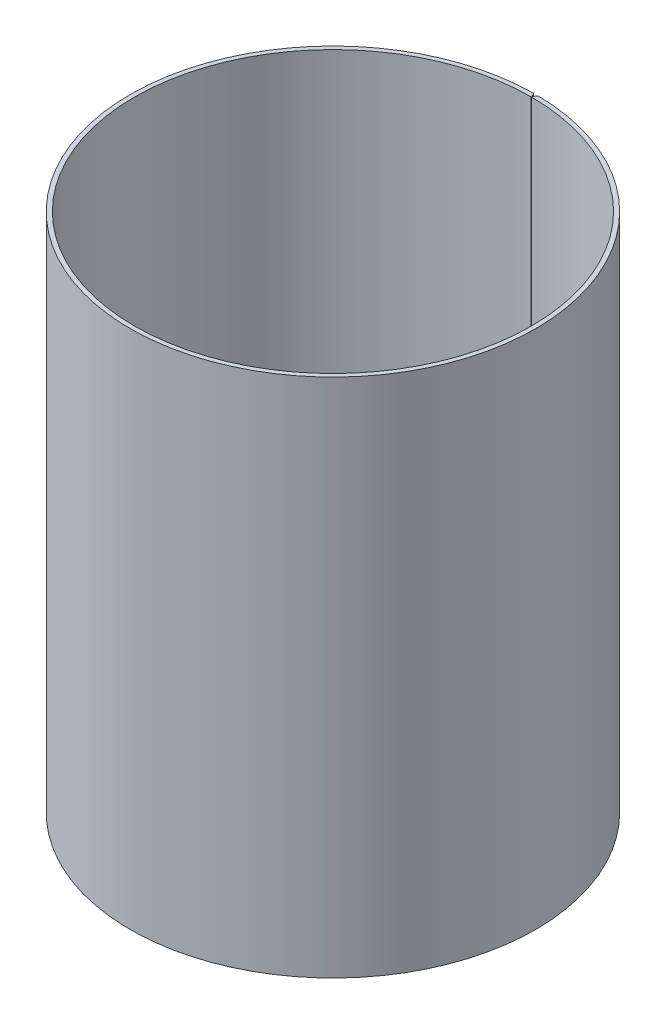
ISO-10303-21;
HEADER;
FILE_DESCRIPTION(('STEP AP214'),'2;1');
FILE_NAME('part.step','',(''),(''),'','','');
FILE_SCHEMA(('AUTOMOTIVE_DESIGN { 1 0 10303 214 1 1 1 1 }'));
ENDSEC;
DATA;
#1=APPLICATION_CONTEXT('core data for automotive mechanical design processes');
#2=APPLICATION_PROTOCOL_DEFINITION('international standard','automotive_design',2000,#1);
#3=PRODUCT_CONTEXT('',#1,'mechanical');
#4=PRODUCT('Part','Part','',(#3));
#5=PRODUCT_RELATED_PRODUCT_CATEGORY('part','',(#4));
#6=PRODUCT_DEFINITION_FORMATION('','',#4);
#7=PRODUCT_DEFINITION_CONTEXT('part definition',#1,'design');
#8=PRODUCT_DEFINITION('design','',#6,#7);
#9=PRODUCT_DEFINITION_SHAPE('','',#8);
#10=(LENGTH_UNIT() NAMED_UNIT(*) SI_UNIT(.MILLI.,.METRE.));
#11=(NAMED_UNIT(*) PLANE_ANGLE_UNIT() SI_UNIT($,.RADIAN.));
#12=(NAMED_UNIT(*) SI_UNIT($,.STERADIAN.) SOLID_ANGLE_UNIT());
#13=UNCERTAINTY_MEASURE_WITH_UNIT(LENGTH_MEASURE(1.E-05),#10,'distance_accuracy_value','');
#14=(GEOMETRIC_REPRESENTATION_CONTEXT(3) GLOBAL_UNCERTAINTY_ASSIGNED_CONTEXT((#13)) GLOBAL_UNIT_ASSIGNED_CONTEXT((#10,
#11,#12)) REPRESENTATION_CONTEXT('',''));
#15=CARTESIAN_POINT('',(0.,0.,0.));
#16=DIRECTION('',(0.,0.,1.));
#17=DIRECTION('',(1.,0.,0.));
#18=AXIS2_PLACEMENT_3D('',#15,#16,#17);
#19=CARTESIAN_POINT('',(0.,-762.,0.));
#20=DIRECTION('',(0.,1.,0.));
#21=DIRECTION('',(0.,0.,1.));
#22=AXIS2_PLACEMENT_3D('',#19,#20,#21);
#23=CYLINDRICAL_SURFACE('',#22,296.8625);
#24=DIRECTION('',(0.,1.,0.));
#25=VECTOR('',#24,1.);
#26=CARTESIAN_POINT('',(3.20888768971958,-762.,-296.845156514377));
#27=LINE('',#26,#25);
#28=CARTESIAN_POINT('',(3.20888768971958,0.,-296.845156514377));
#29=VERTEX_POINT('',#28);
#30=CARTESIAN_POINT('',(3.20888768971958,-762.,-296.845156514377));
#31=VERTEX_POINT('',#30);
#32=EDGE_CURVE('E113',#29,#31,#27,.F.);
#33=ORIENTED_EDGE('',*,*,#32,.F.);
#34=CARTESIAN_POINT('',(0.,0.,0.));
#35=DIRECTION('',(0.,1.,0.));
#36=DIRECTION('',(0.,0.,1.));
#37=AXIS2_PLACEMENT_3D('',#34,#35,#36);
#38=CIRCLE('',#37,296.8625);
#39=CARTESIAN_POINT('',(-3.20888768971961,0.,-296.845156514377));
#40=VERTEX_POINT('',#39);
#41=EDGE_CURVE('E103',#40,#29,#38,.T.);
#42=ORIENTED_EDGE('',*,*,#41,.F.);
#43=DIRECTION('',(0.,1.,0.));
#44=VECTOR('',#43,1.);
#45=CARTESIAN_POINT('',(-3.20888768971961,-762.,-296.845156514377));
#46=LINE('',#45,#44);
#47=CARTESIAN_POINT('',(-3.20888768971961,-762.,-296.845156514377));
#48=VERTEX_POINT('',#47);
#49=EDGE_CURVE('E98',#48,#40,#46,.T.);
#50=ORIENTED_EDGE('',*,*,#49,.F.);
#51=CARTESIAN_POINT('',(0.,-762.,0.));
#52=DIRECTION('',(0.,1.,0.));
#53=DIRECTION('',(0.,0.,1.));
#54=AXIS2_PLACEMENT_3D('',#51,#52,#53);
#55=CIRCLE('',#54,296.8625);
#56=EDGE_CURVE('E99',#48,#31,#55,.T.);
#57=ORIENTED_EDGE('',*,*,#56,.T.);
#58=EDGE_LOOP('',(#33,#42,#50,#57));
#59=FACE_BOUND('',#58,.T.);
#60=ADVANCED_FACE('F30',(#59),#23,.T.);
#61=CARTESIAN_POINT('',(0.,-762.,0.));
#62=DIRECTION('',(0.,1.,0.));
#63=DIRECTION('',(0.,0.,1.));
#64=AXIS2_PLACEMENT_3D('',#61,#62,#63);
#65=PLANE('',#64);
#66=DIRECTION('',(0.499999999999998,0.,0.86602540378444));
#67=VECTOR('',#66,1.);
#68=CARTESIAN_POINT('',(126.131057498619,-762.,-72.8217999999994));
#69=LINE('',#68,#67);
#70=CARTESIAN_POINT('',(-0.190500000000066,-762.,-291.617155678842));
#71=VERTEX_POINT('',#70);
#72=EDGE_CURVE('E116',#48,#71,#69,.T.);
#73=ORIENTED_EDGE('',*,*,#72,.T.);
#74=DIRECTION('',(0.,0.,1.));
#75=VECTOR('',#74,1.);
#76=CARTESIAN_POINT('',(-0.190500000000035,-762.,-288.925));
#77=LINE('',#76,#75);
#78=CARTESIAN_POINT('',(-0.190500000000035,-762.,-290.512437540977));
#79=VERTEX_POINT('',#78);
#80=EDGE_CURVE('E51',#71,#79,#77,.T.);
#81=ORIENTED_EDGE('',*,*,#80,.T.);
#82=CARTESIAN_POINT('',(0.,-762.,0.));
#83=DIRECTION('',(0.,1.,0.));
#84=DIRECTION('',(0.,0.,1.));
#85=AXIS2_PLACEMENT_3D('',#82,#83,#84);
#86=CIRCLE('',#85,290.5125);
#87=CARTESIAN_POINT('',(0.190499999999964,-762.,-290.512437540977));
#88=VERTEX_POINT('',#87);
#89=EDGE_CURVE('E107',#79,#88,#86,.T.);
#90=ORIENTED_EDGE('',*,*,#89,.T.);
#91=DIRECTION('',(0.,0.,-1.));
#92=VECTOR('',#91,1.);
#93=CARTESIAN_POINT('',(0.190499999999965,-762.,-288.925));
#94=LINE('',#93,#92);
#95=CARTESIAN_POINT('',(0.190499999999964,-762.,-291.617155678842));
#96=VERTEX_POINT('',#95);
#97=EDGE_CURVE('E124',#88,#96,#94,.T.);
#98=ORIENTED_EDGE('',*,*,#97,.T.);
#99=DIRECTION('',(0.499999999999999,0.,-0.866025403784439));
#100=VECTOR('',#99,1.);
#101=CARTESIAN_POINT('',(-126.131057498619,-762.,-72.8217999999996));
#102=LINE('',#101,#100);
#103=EDGE_CURVE('E111',#96,#31,#102,.T.);
#104=ORIENTED_EDGE('',*,*,#103,.T.);
#105=ORIENTED_EDGE('',*,*,#56,.F.);
#106=EDGE_LOOP('',(#73,#81,#90,#98,#104,#105));
#107=FACE_BOUND('',#106,.T.);
#108=ADVANCED_FACE('F130',(#107),#65,.F.);
#109=CARTESIAN_POINT('',(0.,0.,0.));
#110=DIRECTION('',(0.,1.,0.));
#111=DIRECTION('',(0.,0.,1.));
#112=AXIS2_PLACEMENT_3D('',#109,#110,#111);
#113=PLANE('',#112);
#114=DIRECTION('',(0.,0.,1.));
#115=VECTOR('',#114,1.);
#116=CARTESIAN_POINT('',(-0.190500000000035,0.,-288.925));
#117=LINE('',#116,#115);
#118=CARTESIAN_POINT('',(-0.190500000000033,0.,-291.617155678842));
#119=VERTEX_POINT('',#118);
#120=CARTESIAN_POINT('',(-0.190500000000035,0.,-290.512437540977));
#121=VERTEX_POINT('',#120);
#122=EDGE_CURVE('E80',#119,#121,#117,.T.);
#123=ORIENTED_EDGE('',*,*,#122,.F.);
#124=DIRECTION('',(0.499999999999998,0.,0.86602540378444));
#125=VECTOR('',#124,1.);
#126=CARTESIAN_POINT('',(126.131057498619,0.,-72.8217999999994));
#127=LINE('',#126,#125);
#128=EDGE_CURVE('E91',#40,#119,#127,.T.);
#129=ORIENTED_EDGE('',*,*,#128,.F.);
#130=ORIENTED_EDGE('',*,*,#41,.T.);
#131=DIRECTION('',(0.499999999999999,0.,-0.866025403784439));
#132=VECTOR('',#131,1.);
#133=CARTESIAN_POINT('',(-126.131057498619,0.,-72.8217999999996));
#134=LINE('',#133,#132);
#135=CARTESIAN_POINT('',(0.190499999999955,0.,-291.617155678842));
#136=VERTEX_POINT('',#135);
#137=EDGE_CURVE('E86',#136,#29,#134,.T.);
#138=ORIENTED_EDGE('',*,*,#137,.F.);
#139=DIRECTION('',(0.,0.,-1.));
#140=VECTOR('',#139,1.);
#141=CARTESIAN_POINT('',(0.190499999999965,0.,-288.925));
#142=LINE('',#141,#140);
#143=CARTESIAN_POINT('',(0.190499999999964,0.,-290.512437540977));
#144=VERTEX_POINT('',#143);
#145=EDGE_CURVE('E44',#144,#136,#142,.T.);
#146=ORIENTED_EDGE('',*,*,#145,.F.);
#147=CARTESIAN_POINT('',(0.,0.,0.));
#148=DIRECTION('',(0.,1.,0.));
#149=DIRECTION('',(0.,0.,1.));
#150=AXIS2_PLACEMENT_3D('',#147,#148,#149);
#151=CIRCLE('',#150,290.5125);
#152=EDGE_CURVE('E94',#121,#144,#151,.T.);
#153=ORIENTED_EDGE('',*,*,#152,.F.);
#154=EDGE_LOOP('',(#123,#129,#130,#138,#146,#153));
#155=FACE_BOUND('',#154,.T.);
#156=ADVANCED_FACE('F89',(#155),#113,.T.);
#157=CARTESIAN_POINT('',(0.,-762.,0.));
#158=DIRECTION('',(0.,1.,0.));
#159=DIRECTION('',(0.,0.,1.));
#160=AXIS2_PLACEMENT_3D('',#157,#158,#159);
#161=CYLINDRICAL_SURFACE('',#160,290.5125);
#162=ORIENTED_EDGE('',*,*,#89,.F.);
#163=DIRECTION('',(0.,1.,0.));
#164=VECTOR('',#163,1.);
#165=CARTESIAN_POINT('',(-0.190500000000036,-762.,-290.512437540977));
#166=LINE('',#165,#164);
#167=EDGE_CURVE('E122',#79,#121,#166,.T.);
#168=ORIENTED_EDGE('',*,*,#167,.T.);
#169=ORIENTED_EDGE('',*,*,#152,.T.);
#170=DIRECTION('',(0.,1.,0.));
#171=VECTOR('',#170,1.);
#172=CARTESIAN_POINT('',(0.190499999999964,-762.,-290.512437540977));
#173=LINE('',#172,#171);
#174=EDGE_CURVE('E119',#144,#88,#173,.F.);
#175=ORIENTED_EDGE('',*,*,#174,.T.);
#176=EDGE_LOOP('',(#162,#168,#169,#175));
#177=FACE_BOUND('',#176,.T.);
#178=ADVANCED_FACE('F133',(#177),#161,.F.);
#179=CARTESIAN_POINT('',(0.,2369.83836779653,-291.2872));
#180=DIRECTION('',(0.866025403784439,0.,0.499999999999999));
#181=DIRECTION('',(0.499999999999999,0.,-0.866025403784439));
#182=AXIS2_PLACEMENT_3D('',#179,#180,#181);
#183=PLANE('',#182);
#184=ORIENTED_EDGE('',*,*,#103,.F.);
#185=DIRECTION('',(0.,1.,0.));
#186=VECTOR('',#185,1.);
#187=CARTESIAN_POINT('',(0.190499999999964,2369.83836779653,-291.617155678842));
#188=LINE('',#187,#186);
#189=EDGE_CURVE('E11',#96,#136,#188,.T.);
#190=ORIENTED_EDGE('',*,*,#189,.T.);
#191=ORIENTED_EDGE('',*,*,#137,.T.);
#192=ORIENTED_EDGE('',*,*,#32,.T.);
#193=EDGE_LOOP('',(#184,#190,#191,#192));
#194=FACE_BOUND('',#193,.T.);
#195=ADVANCED_FACE('F139',(#194),#183,.F.);
#196=CARTESIAN_POINT('',(0.,2369.83836779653,-291.2872));
#197=DIRECTION('',(-0.86602540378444,0.,0.499999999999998));
#198=DIRECTION('',(0.499999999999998,0.,0.86602540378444));
#199=AXIS2_PLACEMENT_3D('',#196,#197,#198);
#200=PLANE('',#199);
#201=ORIENTED_EDGE('',*,*,#128,.T.);
#202=DIRECTION('',(0.,-1.,0.));
#203=VECTOR('',#202,1.);
#204=CARTESIAN_POINT('',(-0.190500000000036,2369.83836779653,-291.617155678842));
#205=LINE('',#204,#203);
#206=EDGE_CURVE('E37',#119,#71,#205,.T.);
#207=ORIENTED_EDGE('',*,*,#206,.T.);
#208=ORIENTED_EDGE('',*,*,#72,.F.);
#209=ORIENTED_EDGE('',*,*,#49,.T.);
#210=EDGE_LOOP('',(#201,#207,#208,#209));
#211=FACE_BOUND('',#210,.T.);
#212=ADVANCED_FACE('F97',(#211),#200,.F.);
#213=CARTESIAN_POINT('',(-0.190500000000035,-762.,-288.925));
#214=DIRECTION('',(-1.,0.,0.));
#215=DIRECTION('',(0.,0.,1.));
#216=AXIS2_PLACEMENT_3D('',#213,#214,#215);
#217=PLANE('',#216);
#218=ORIENTED_EDGE('',*,*,#80,.F.);
#219=ORIENTED_EDGE('',*,*,#206,.F.);
#220=ORIENTED_EDGE('',*,*,#122,.T.);
#221=ORIENTED_EDGE('',*,*,#167,.F.);
#222=EDGE_LOOP('',(#218,#219,#220,#221));
#223=FACE_BOUND('',#222,.T.);
#224=ADVANCED_FACE('F79',(#223),#217,.F.);
#225=CARTESIAN_POINT('',(0.190499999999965,-762.,-288.925));
#226=DIRECTION('',(1.,0.,0.));
#227=DIRECTION('',(0.,0.,-1.));
#228=AXIS2_PLACEMENT_3D('',#225,#226,#227);
#229=PLANE('',#228);
#230=ORIENTED_EDGE('',*,*,#145,.T.);
#231=ORIENTED_EDGE('',*,*,#189,.F.);
#232=ORIENTED_EDGE('',*,*,#97,.F.);
#233=ORIENTED_EDGE('',*,*,#174,.F.);
#234=EDGE_LOOP('',(#230,#231,#232,#233));
#235=FACE_BOUND('',#234,.T.);
#236=ADVANCED_FACE('F134',(#235),#229,.F.);
#237=CLOSED_SHELL('',(#60,#108,#156,#178,#195,#212,#224,#236));
#238=MANIFOLD_SOLID_BREP('B2',#237);
#239=ADVANCED_BREP_SHAPE_REPRESENTATION('',(#18,#238),#14);
#240=SHAPE_DEFINITION_REPRESENTATION(#9,#239);
ENDSEC;
END-ISO-10303-21;
